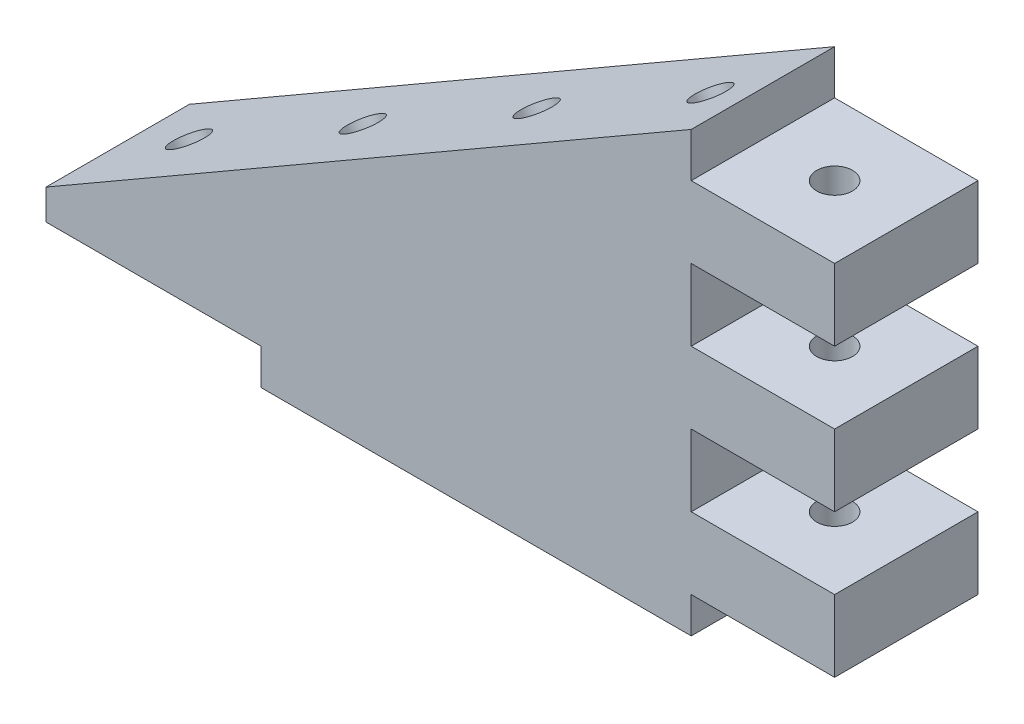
ISO-10303-21;
HEADER;
FILE_DESCRIPTION(('STEP AP214'),'2;1');
FILE_NAME('part.step','',(''),(''),'','','');
FILE_SCHEMA(('AUTOMOTIVE_DESIGN { 1 0 10303 214 1 1 1 1 }'));
ENDSEC;
DATA;
#1=APPLICATION_CONTEXT('core data for automotive mechanical design processes');
#2=APPLICATION_PROTOCOL_DEFINITION('international standard','automotive_design',2000,#1);
#3=PRODUCT_CONTEXT('',#1,'mechanical');
#4=PRODUCT('Part','Part','',(#3));
#5=PRODUCT_RELATED_PRODUCT_CATEGORY('part','',(#4));
#6=PRODUCT_DEFINITION_FORMATION('','',#4);
#7=PRODUCT_DEFINITION_CONTEXT('part definition',#1,'design');
#8=PRODUCT_DEFINITION('design','',#6,#7);
#9=PRODUCT_DEFINITION_SHAPE('','',#8);
#10=(LENGTH_UNIT() NAMED_UNIT(*) SI_UNIT(.MILLI.,.METRE.));
#11=(NAMED_UNIT(*) PLANE_ANGLE_UNIT() SI_UNIT($,.RADIAN.));
#12=(NAMED_UNIT(*) SI_UNIT($,.STERADIAN.) SOLID_ANGLE_UNIT());
#13=UNCERTAINTY_MEASURE_WITH_UNIT(LENGTH_MEASURE(1.E-05),#10,'distance_accuracy_value','');
#14=(GEOMETRIC_REPRESENTATION_CONTEXT(3) GLOBAL_UNCERTAINTY_ASSIGNED_CONTEXT((#13)) GLOBAL_UNIT_ASSIGNED_CONTEXT((#10,
#11,#12)) REPRESENTATION_CONTEXT('',''));
#15=CARTESIAN_POINT('',(0.,0.,0.));
#16=DIRECTION('',(0.,0.,1.));
#17=DIRECTION('',(1.,0.,0.));
#18=AXIS2_PLACEMENT_3D('',#15,#16,#17);
#19=CARTESIAN_POINT('',(10.,0.,10.));
#20=DIRECTION('',(1.,0.,0.));
#21=DIRECTION('',(0.,1.,0.));
#22=AXIS2_PLACEMENT_3D('',#19,#20,#21);
#23=PLANE('',#22);
#24=DIRECTION('',(0.,0.,1.));
#25=VECTOR('',#24,1.);
#26=CARTESIAN_POINT('',(10.,55.,-10.));
#27=LINE('',#26,#25);
#28=CARTESIAN_POINT('',(10.,55.,-10.));
#29=VERTEX_POINT('',#28);
#30=CARTESIAN_POINT('',(10.,55.,10.));
#31=VERTEX_POINT('',#30);
#32=EDGE_CURVE('E60',#29,#31,#27,.T.);
#33=ORIENTED_EDGE('',*,*,#32,.T.);
#34=DIRECTION('',(0.,-1.,0.));
#35=VECTOR('',#34,1.);
#36=CARTESIAN_POINT('',(10.,0.,10.));
#37=LINE('',#36,#35);
#38=CARTESIAN_POINT('',(10.,45.,10.));
#39=VERTEX_POINT('',#38);
#40=EDGE_CURVE('E317',#31,#39,#37,.T.);
#41=ORIENTED_EDGE('',*,*,#40,.T.);
#42=DIRECTION('',(0.,0.,1.));
#43=VECTOR('',#42,1.);
#44=CARTESIAN_POINT('',(10.,45.,-10.));
#45=LINE('',#44,#43);
#46=CARTESIAN_POINT('',(10.,45.,-10.));
#47=VERTEX_POINT('',#46);
#48=EDGE_CURVE('E234',#47,#39,#45,.T.);
#49=ORIENTED_EDGE('',*,*,#48,.F.);
#50=DIRECTION('',(0.,-1.,0.));
#51=VECTOR('',#50,1.);
#52=CARTESIAN_POINT('',(10.,0.,-10.));
#53=LINE('',#52,#51);
#54=EDGE_CURVE('E311',#29,#47,#53,.T.);
#55=ORIENTED_EDGE('',*,*,#54,.F.);
#56=EDGE_LOOP('',(#33,#41,#49,#55));
#57=FACE_BOUND('',#56,.T.);
#58=ADVANCED_FACE('F35',(#57),#23,.T.);
#59=CARTESIAN_POINT('',(0.,0.,0.));
#60=DIRECTION('',(0.,1.,0.));
#61=DIRECTION('',(0.,0.,1.));
#62=AXIS2_PLACEMENT_3D('',#59,#60,#61);
#63=CYLINDRICAL_SURFACE('',#62,2.5);
#64=CARTESIAN_POINT('',(0.,55.,0.));
#65=DIRECTION('',(0.,-1.,0.));
#66=DIRECTION('',(0.,0.,-1.));
#67=AXIS2_PLACEMENT_3D('',#64,#65,#66);
#68=CIRCLE('',#67,2.5);
#69=CARTESIAN_POINT('',(0.,55.,-2.5));
#70=VERTEX_POINT('',#69);
#71=EDGE_CURVE('E205',#70,#70,#68,.F.);
#72=ORIENTED_EDGE('',*,*,#71,.T.);
#73=EDGE_LOOP('',(#72));
#74=FACE_BOUND('',#73,.T.);
#75=CARTESIAN_POINT('',(0.,45.,0.));
#76=DIRECTION('',(0.,1.,0.));
#77=DIRECTION('',(0.,0.,1.));
#78=AXIS2_PLACEMENT_3D('',#75,#76,#77);
#79=CIRCLE('',#78,2.5);
#80=CARTESIAN_POINT('',(0.,45.,2.5));
#81=VERTEX_POINT('',#80);
#82=EDGE_CURVE('E243',#81,#81,#79,.F.);
#83=ORIENTED_EDGE('',*,*,#82,.T.);
#84=EDGE_LOOP('',(#83));
#85=FACE_BOUND('',#84,.T.);
#86=ADVANCED_FACE('F362',(#74,#85),#63,.F.);
#87=DIRECTION('',(0.,0.,1.));
#88=VECTOR('',#87,1.);
#89=CARTESIAN_POINT('',(10.,35.,-10.));
#90=LINE('',#89,#88);
#91=CARTESIAN_POINT('',(10.,35.,-10.));
#92=VERTEX_POINT('',#91);
#93=CARTESIAN_POINT('',(10.,35.,10.));
#94=VERTEX_POINT('',#93);
#95=EDGE_CURVE('E237',#92,#94,#90,.T.);
#96=ORIENTED_EDGE('',*,*,#95,.T.);
#97=CARTESIAN_POINT('',(10.,25.,10.));
#98=VERTEX_POINT('',#97);
#99=EDGE_CURVE('E320',#94,#98,#37,.T.);
#100=ORIENTED_EDGE('',*,*,#99,.T.);
#101=DIRECTION('',(0.,0.,1.));
#102=VECTOR('',#101,1.);
#103=CARTESIAN_POINT('',(10.,25.,-10.));
#104=LINE('',#103,#102);
#105=CARTESIAN_POINT('',(10.,25.,-10.));
#106=VERTEX_POINT('',#105);
#107=EDGE_CURVE('E267',#106,#98,#104,.T.);
#108=ORIENTED_EDGE('',*,*,#107,.F.);
#109=EDGE_CURVE('E328',#92,#106,#53,.T.);
#110=ORIENTED_EDGE('',*,*,#109,.F.);
#111=EDGE_LOOP('',(#96,#100,#108,#110));
#112=FACE_BOUND('',#111,.T.);
#113=ADVANCED_FACE('F365',(#112),#23,.T.);
#114=CARTESIAN_POINT('',(0.,35.,0.));
#115=DIRECTION('',(0.,-1.,0.));
#116=DIRECTION('',(0.,0.,-1.));
#117=AXIS2_PLACEMENT_3D('',#114,#115,#116);
#118=CIRCLE('',#117,2.5);
#119=CARTESIAN_POINT('',(0.,35.,-2.5));
#120=VERTEX_POINT('',#119);
#121=EDGE_CURVE('E233',#120,#120,#118,.F.);
#122=ORIENTED_EDGE('',*,*,#121,.T.);
#123=EDGE_LOOP('',(#122));
#124=FACE_BOUND('',#123,.T.);
#125=CARTESIAN_POINT('',(0.,25.,0.));
#126=DIRECTION('',(0.,1.,0.));
#127=DIRECTION('',(0.,0.,1.));
#128=AXIS2_PLACEMENT_3D('',#125,#126,#127);
#129=CIRCLE('',#128,2.5);
#130=CARTESIAN_POINT('',(0.,25.,2.5));
#131=VERTEX_POINT('',#130);
#132=EDGE_CURVE('E39',#131,#131,#129,.F.);
#133=ORIENTED_EDGE('',*,*,#132,.T.);
#134=EDGE_LOOP('',(#133));
#135=FACE_BOUND('',#134,.T.);
#136=ADVANCED_FACE('F344',(#124,#135),#63,.F.);
#137=CARTESIAN_POINT('',(-28.9951905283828,50.2211431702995,10.));
#138=DIRECTION('',(0.499999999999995,-0.866025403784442,0.));
#139=DIRECTION('',(0.866025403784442,0.499999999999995,0.));
#140=AXIS2_PLACEMENT_3D('',#137,#138,#139);
#141=PLANE('',#140);
#142=CARTESIAN_POINT('',(-41.5692193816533,42.9615242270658,0.));
#143=DIRECTION('',(-0.499999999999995,0.866025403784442,0.));
#144=DIRECTION('',(-0.866025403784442,-0.499999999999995,0.));
#145=AXIS2_PLACEMENT_3D('',#142,#143,#144);
#146=CIRCLE('',#145,2.5);
#147=CARTESIAN_POINT('',(-43.7342828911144,41.7115242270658,0.));
#148=VERTEX_POINT('',#147);
#149=EDGE_CURVE('E274',#148,#148,#146,.T.);
#150=ORIENTED_EDGE('',*,*,#149,.F.);
#151=EDGE_LOOP('',(#150));
#152=FACE_BOUND('',#151,.T.);
#153=CARTESIAN_POINT('',(-17.3205080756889,56.9615242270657,0.));
#154=DIRECTION('',(-0.499999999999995,0.866025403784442,0.));
#155=DIRECTION('',(-0.866025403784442,-0.499999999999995,0.));
#156=AXIS2_PLACEMENT_3D('',#153,#154,#155);
#157=CIRCLE('',#156,2.5);
#158=CARTESIAN_POINT('',(-19.48557158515,55.7115242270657,0.));
#159=VERTEX_POINT('',#158);
#160=EDGE_CURVE('E280',#159,#159,#157,.T.);
#161=ORIENTED_EDGE('',*,*,#160,.F.);
#162=EDGE_LOOP('',(#161));
#163=FACE_BOUND('',#162,.T.);
#164=DIRECTION('',(-0.866025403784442,-0.499999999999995,0.));
#165=VECTOR('',#164,1.);
#166=CARTESIAN_POINT('',(-28.9951905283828,50.2211431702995,10.));
#167=LINE('',#166,#165);
#168=CARTESIAN_POINT('',(-10.,61.1880215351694,10.));
#169=VERTEX_POINT('',#168);
#170=CARTESIAN_POINT('',(-100.,9.22649730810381,10.));
#171=VERTEX_POINT('',#170);
#172=EDGE_CURVE('E307',#169,#171,#167,.T.);
#173=ORIENTED_EDGE('',*,*,#172,.F.);
#174=DIRECTION('',(0.,0.,-1.));
#175=VECTOR('',#174,1.);
#176=CARTESIAN_POINT('',(-10.,61.1880215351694,10.));
#177=LINE('',#176,#175);
#178=CARTESIAN_POINT('',(-10.,61.1880215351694,-10.));
#179=VERTEX_POINT('',#178);
#180=EDGE_CURVE('E210',#169,#179,#177,.T.);
#181=ORIENTED_EDGE('',*,*,#180,.T.);
#182=DIRECTION('',(-0.866025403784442,-0.499999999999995,0.));
#183=VECTOR('',#182,1.);
#184=CARTESIAN_POINT('',(-28.9951905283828,50.2211431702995,-10.));
#185=LINE('',#184,#183);
#186=CARTESIAN_POINT('',(-100.,9.22649730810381,-10.));
#187=VERTEX_POINT('',#186);
#188=EDGE_CURVE('E306',#179,#187,#185,.T.);
#189=ORIENTED_EDGE('',*,*,#188,.T.);
#190=DIRECTION('',(0.,0.,-1.));
#191=VECTOR('',#190,1.);
#192=CARTESIAN_POINT('',(-100.,9.22649730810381,10.));
#193=LINE('',#192,#191);
#194=EDGE_CURVE('E319',#171,#187,#193,.T.);
#195=ORIENTED_EDGE('',*,*,#194,.F.);
#196=EDGE_LOOP('',(#173,#181,#189,#195));
#197=FACE_BOUND('',#196,.T.);
#198=CARTESIAN_POINT('',(-65.8179306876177,28.961524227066,0.));
#199=DIRECTION('',(-0.499999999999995,0.866025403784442,0.));
#200=DIRECTION('',(-0.866025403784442,-0.499999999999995,0.));
#201=AXIS2_PLACEMENT_3D('',#198,#199,#200);
#202=CIRCLE('',#201,2.5);
#203=CARTESIAN_POINT('',(-67.9829941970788,27.711524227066,0.));
#204=VERTEX_POINT('',#203);
#205=EDGE_CURVE('E331',#204,#204,#202,.T.);
#206=ORIENTED_EDGE('',*,*,#205,.F.);
#207=EDGE_LOOP('',(#206));
#208=FACE_BOUND('',#207,.T.);
#209=CARTESIAN_POINT('',(-90.066641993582,14.9615242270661,0.));
#210=DIRECTION('',(-0.499999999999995,0.866025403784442,0.));
#211=DIRECTION('',(-0.866025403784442,-0.499999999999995,0.));
#212=AXIS2_PLACEMENT_3D('',#209,#210,#211);
#213=CIRCLE('',#212,2.5);
#214=CARTESIAN_POINT('',(-92.2317055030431,13.7115242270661,0.));
#215=VERTEX_POINT('',#214);
#216=EDGE_CURVE('E44',#215,#215,#213,.T.);
#217=ORIENTED_EDGE('',*,*,#216,.F.);
#218=EDGE_LOOP('',(#217));
#219=FACE_BOUND('',#218,.T.);
#220=ADVANCED_FACE('F420',(#152,#163,#197,#208,#219),#141,.F.);
#221=CARTESIAN_POINT('',(-100.,0.,10.));
#222=DIRECTION('',(-1.,0.,0.));
#223=DIRECTION('',(0.,0.,1.));
#224=AXIS2_PLACEMENT_3D('',#221,#222,#223);
#225=PLANE('',#224);
#226=DIRECTION('',(0.,0.,1.));
#227=VECTOR('',#226,1.);
#228=CARTESIAN_POINT('',(-100.,5.,-10.));
#229=LINE('',#228,#227);
#230=CARTESIAN_POINT('',(-100.,5.,-10.));
#231=VERTEX_POINT('',#230);
#232=CARTESIAN_POINT('',(-100.,5.,10.));
#233=VERTEX_POINT('',#232);
#234=EDGE_CURVE('E52',#231,#233,#229,.T.);
#235=ORIENTED_EDGE('',*,*,#234,.T.);
#236=DIRECTION('',(0.,1.,0.));
#237=VECTOR('',#236,1.);
#238=CARTESIAN_POINT('',(-100.,0.,10.));
#239=LINE('',#238,#237);
#240=EDGE_CURVE('E310',#233,#171,#239,.T.);
#241=ORIENTED_EDGE('',*,*,#240,.T.);
#242=ORIENTED_EDGE('',*,*,#194,.T.);
#243=DIRECTION('',(0.,1.,0.));
#244=VECTOR('',#243,1.);
#245=CARTESIAN_POINT('',(-100.,0.,-10.));
#246=LINE('',#245,#244);
#247=EDGE_CURVE('E323',#231,#187,#246,.T.);
#248=ORIENTED_EDGE('',*,*,#247,.F.);
#249=EDGE_LOOP('',(#235,#241,#242,#248));
#250=FACE_BOUND('',#249,.T.);
#251=ADVANCED_FACE('F387',(#250),#225,.T.);
#252=CARTESIAN_POINT('',(0.,0.,10.));
#253=DIRECTION('',(0.,-1.,0.));
#254=DIRECTION('',(1.,0.,0.));
#255=AXIS2_PLACEMENT_3D('',#252,#253,#254);
#256=PLANE('',#255);
#257=DIRECTION('',(0.,0.,1.));
#258=VECTOR('',#257,1.);
#259=CARTESIAN_POINT('',(-70.,0.,-10.));
#260=LINE('',#259,#258);
#261=CARTESIAN_POINT('',(-70.,0.,-10.));
#262=VERTEX_POINT('',#261);
#263=CARTESIAN_POINT('',(-70.,0.,10.));
#264=VERTEX_POINT('',#263);
#265=EDGE_CURVE('E191',#262,#264,#260,.T.);
#266=ORIENTED_EDGE('',*,*,#265,.F.);
#267=DIRECTION('',(-1.,0.,0.));
#268=VECTOR('',#267,1.);
#269=CARTESIAN_POINT('',(0.,0.,-10.));
#270=LINE('',#269,#268);
#271=CARTESIAN_POINT('',(-10.,0.,-10.));
#272=VERTEX_POINT('',#271);
#273=EDGE_CURVE('E181',#272,#262,#270,.T.);
#274=ORIENTED_EDGE('',*,*,#273,.F.);
#275=DIRECTION('',(0.,0.,-1.));
#276=VECTOR('',#275,1.);
#277=CARTESIAN_POINT('',(-10.,0.,10.));
#278=LINE('',#277,#276);
#279=CARTESIAN_POINT('',(-10.,0.,10.));
#280=VERTEX_POINT('',#279);
#281=EDGE_CURVE('E302',#280,#272,#278,.T.);
#282=ORIENTED_EDGE('',*,*,#281,.F.);
#283=DIRECTION('',(-1.,0.,0.));
#284=VECTOR('',#283,1.);
#285=CARTESIAN_POINT('',(0.,0.,10.));
#286=LINE('',#285,#284);
#287=EDGE_CURVE('E313',#280,#264,#286,.T.);
#288=ORIENTED_EDGE('',*,*,#287,.T.);
#289=EDGE_LOOP('',(#266,#274,#282,#288));
#290=FACE_BOUND('',#289,.T.);
#291=ADVANCED_FACE('F379',(#290),#256,.T.);
#292=DIRECTION('',(0.,0.,1.));
#293=VECTOR('',#292,1.);
#294=CARTESIAN_POINT('',(10.,15.,-10.));
#295=LINE('',#294,#293);
#296=CARTESIAN_POINT('',(10.,15.,-10.));
#297=VERTEX_POINT('',#296);
#298=CARTESIAN_POINT('',(10.,15.,10.));
#299=VERTEX_POINT('',#298);
#300=EDGE_CURVE('E270',#297,#299,#295,.T.);
#301=ORIENTED_EDGE('',*,*,#300,.T.);
#302=CARTESIAN_POINT('',(10.,5.,10.));
#303=VERTEX_POINT('',#302);
#304=EDGE_CURVE('E316',#299,#303,#37,.T.);
#305=ORIENTED_EDGE('',*,*,#304,.T.);
#306=DIRECTION('',(0.,0.,1.));
#307=VECTOR('',#306,1.);
#308=CARTESIAN_POINT('',(10.,5.,-10.));
#309=LINE('',#308,#307);
#310=CARTESIAN_POINT('',(10.,5.,-10.));
#311=VERTEX_POINT('',#310);
#312=EDGE_CURVE('E296',#311,#303,#309,.T.);
#313=ORIENTED_EDGE('',*,*,#312,.F.);
#314=EDGE_CURVE('E326',#297,#311,#53,.T.);
#315=ORIENTED_EDGE('',*,*,#314,.F.);
#316=EDGE_LOOP('',(#301,#305,#313,#315));
#317=FACE_BOUND('',#316,.T.);
#318=ADVANCED_FACE('F366',(#317),#23,.T.);
#319=CARTESIAN_POINT('',(0.,0.,10.));
#320=DIRECTION('',(0.,0.,1.));
#321=DIRECTION('',(1.,0.,0.));
#322=AXIS2_PLACEMENT_3D('',#319,#320,#321);
#323=PLANE('',#322);
#324=DIRECTION('',(0.,1.,0.));
#325=VECTOR('',#324,1.);
#326=CARTESIAN_POINT('',(-70.,5.,10.));
#327=LINE('',#326,#325);
#328=CARTESIAN_POINT('',(-70.,5.,10.));
#329=VERTEX_POINT('',#328);
#330=EDGE_CURVE('E169',#264,#329,#327,.T.);
#331=ORIENTED_EDGE('',*,*,#330,.F.);
#332=ORIENTED_EDGE('',*,*,#287,.F.);
#333=DIRECTION('',(0.,-1.,0.));
#334=VECTOR('',#333,1.);
#335=CARTESIAN_POINT('',(-10.,-5.,10.));
#336=LINE('',#335,#334);
#337=CARTESIAN_POINT('',(-10.,5.,10.));
#338=VERTEX_POINT('',#337);
#339=EDGE_CURVE('E289',#338,#280,#336,.T.);
#340=ORIENTED_EDGE('',*,*,#339,.F.);
#341=DIRECTION('',(-1.,0.,0.));
#342=VECTOR('',#341,1.);
#343=CARTESIAN_POINT('',(10.,5.,10.));
#344=LINE('',#343,#342);
#345=EDGE_CURVE('E293',#303,#338,#344,.T.);
#346=ORIENTED_EDGE('',*,*,#345,.F.);
#347=ORIENTED_EDGE('',*,*,#304,.F.);
#348=DIRECTION('',(1.,0.,0.));
#349=VECTOR('',#348,1.);
#350=CARTESIAN_POINT('',(10.,15.,10.));
#351=LINE('',#350,#349);
#352=CARTESIAN_POINT('',(-10.,15.,10.));
#353=VERTEX_POINT('',#352);
#354=EDGE_CURVE('E260',#353,#299,#351,.T.);
#355=ORIENTED_EDGE('',*,*,#354,.F.);
#356=DIRECTION('',(0.,-1.,0.));
#357=VECTOR('',#356,1.);
#358=CARTESIAN_POINT('',(-10.,15.,10.));
#359=LINE('',#358,#357);
#360=CARTESIAN_POINT('',(-10.,25.,10.));
#361=VERTEX_POINT('',#360);
#362=EDGE_CURVE('E246',#361,#353,#359,.T.);
#363=ORIENTED_EDGE('',*,*,#362,.F.);
#364=DIRECTION('',(-1.,0.,0.));
#365=VECTOR('',#364,1.);
#366=CARTESIAN_POINT('',(10.,25.,10.));
#367=LINE('',#366,#365);
#368=EDGE_CURVE('E251',#98,#361,#367,.T.);
#369=ORIENTED_EDGE('',*,*,#368,.F.);
#370=ORIENTED_EDGE('',*,*,#99,.F.);
#371=DIRECTION('',(1.,0.,0.));
#372=VECTOR('',#371,1.);
#373=CARTESIAN_POINT('',(10.,35.,10.));
#374=LINE('',#373,#372);
#375=CARTESIAN_POINT('',(-10.,35.,10.));
#376=VERTEX_POINT('',#375);
#377=EDGE_CURVE('E227',#376,#94,#374,.T.);
#378=ORIENTED_EDGE('',*,*,#377,.F.);
#379=DIRECTION('',(0.,-1.,0.));
#380=VECTOR('',#379,1.);
#381=CARTESIAN_POINT('',(-10.,35.,10.));
#382=LINE('',#381,#380);
#383=CARTESIAN_POINT('',(-10.,45.,10.));
#384=VERTEX_POINT('',#383);
#385=EDGE_CURVE('E213',#384,#376,#382,.T.);
#386=ORIENTED_EDGE('',*,*,#385,.F.);
#387=DIRECTION('',(-1.,0.,0.));
#388=VECTOR('',#387,1.);
#389=CARTESIAN_POINT('',(10.,45.,10.));
#390=LINE('',#389,#388);
#391=EDGE_CURVE('E218',#39,#384,#390,.T.);
#392=ORIENTED_EDGE('',*,*,#391,.F.);
#393=ORIENTED_EDGE('',*,*,#40,.F.);
#394=DIRECTION('',(1.,0.,0.));
#395=VECTOR('',#394,1.);
#396=CARTESIAN_POINT('',(10.,55.,10.));
#397=LINE('',#396,#395);
#398=CARTESIAN_POINT('',(-10.,55.,10.));
#399=VERTEX_POINT('',#398);
#400=EDGE_CURVE('E199',#399,#31,#397,.T.);
#401=ORIENTED_EDGE('',*,*,#400,.F.);
#402=DIRECTION('',(0.,-1.,0.));
#403=VECTOR('',#402,1.);
#404=CARTESIAN_POINT('',(-10.,55.,10.));
#405=LINE('',#404,#403);
#406=EDGE_CURVE('E193',#169,#399,#405,.T.);
#407=ORIENTED_EDGE('',*,*,#406,.F.);
#408=ORIENTED_EDGE('',*,*,#172,.T.);
#409=ORIENTED_EDGE('',*,*,#240,.F.);
#410=DIRECTION('',(-1.,0.,0.));
#411=VECTOR('',#410,1.);
#412=CARTESIAN_POINT('',(-100.,5.,10.));
#413=LINE('',#412,#411);
#414=EDGE_CURVE('E182',#329,#233,#413,.T.);
#415=ORIENTED_EDGE('',*,*,#414,.F.);
#416=EDGE_LOOP('',(#331,#332,#340,#346,#347,#355,#363,#369,#370,#378,#386,#392,#393,#401,#407,
#408,#409,#415));
#417=FACE_BOUND('',#416,.T.);
#418=ADVANCED_FACE('F378',(#417),#323,.T.);
#419=CARTESIAN_POINT('',(0.,0.,-10.));
#420=DIRECTION('',(0.,0.,1.));
#421=DIRECTION('',(1.,0.,0.));
#422=AXIS2_PLACEMENT_3D('',#419,#420,#421);
#423=PLANE('',#422);
#424=ORIENTED_EDGE('',*,*,#273,.T.);
#425=DIRECTION('',(0.,1.,0.));
#426=VECTOR('',#425,1.);
#427=CARTESIAN_POINT('',(-70.,5.,-10.));
#428=LINE('',#427,#426);
#429=CARTESIAN_POINT('',(-70.,5.,-10.));
#430=VERTEX_POINT('',#429);
#431=EDGE_CURVE('E166',#262,#430,#428,.T.);
#432=ORIENTED_EDGE('',*,*,#431,.T.);
#433=DIRECTION('',(-1.,0.,0.));
#434=VECTOR('',#433,1.);
#435=CARTESIAN_POINT('',(-100.,5.,-10.));
#436=LINE('',#435,#434);
#437=EDGE_CURVE('E171',#430,#231,#436,.T.);
#438=ORIENTED_EDGE('',*,*,#437,.T.);
#439=ORIENTED_EDGE('',*,*,#247,.T.);
#440=ORIENTED_EDGE('',*,*,#188,.F.);
#441=DIRECTION('',(0.,-1.,0.));
#442=VECTOR('',#441,1.);
#443=CARTESIAN_POINT('',(-10.,55.,-10.));
#444=LINE('',#443,#442);
#445=CARTESIAN_POINT('',(-10.,55.,-10.));
#446=VERTEX_POINT('',#445);
#447=EDGE_CURVE('E195',#179,#446,#444,.T.);
#448=ORIENTED_EDGE('',*,*,#447,.T.);
#449=DIRECTION('',(1.,0.,0.));
#450=VECTOR('',#449,1.);
#451=CARTESIAN_POINT('',(10.,55.,-10.));
#452=LINE('',#451,#450);
#453=EDGE_CURVE('E198',#446,#29,#452,.T.);
#454=ORIENTED_EDGE('',*,*,#453,.T.);
#455=ORIENTED_EDGE('',*,*,#54,.T.);
#456=DIRECTION('',(-1.,0.,0.));
#457=VECTOR('',#456,1.);
#458=CARTESIAN_POINT('',(10.,45.,-10.));
#459=LINE('',#458,#457);
#460=CARTESIAN_POINT('',(-10.,45.,-10.));
#461=VERTEX_POINT('',#460);
#462=EDGE_CURVE('E221',#47,#461,#459,.T.);
#463=ORIENTED_EDGE('',*,*,#462,.T.);
#464=DIRECTION('',(0.,-1.,0.));
#465=VECTOR('',#464,1.);
#466=CARTESIAN_POINT('',(-10.,35.,-10.));
#467=LINE('',#466,#465);
#468=CARTESIAN_POINT('',(-10.,35.,-10.));
#469=VERTEX_POINT('',#468);
#470=EDGE_CURVE('E214',#461,#469,#467,.T.);
#471=ORIENTED_EDGE('',*,*,#470,.T.);
#472=DIRECTION('',(1.,0.,0.));
#473=VECTOR('',#472,1.);
#474=CARTESIAN_POINT('',(10.,35.,-10.));
#475=LINE('',#474,#473);
#476=EDGE_CURVE('E217',#469,#92,#475,.T.);
#477=ORIENTED_EDGE('',*,*,#476,.T.);
#478=ORIENTED_EDGE('',*,*,#109,.T.);
#479=DIRECTION('',(-1.,0.,0.));
#480=VECTOR('',#479,1.);
#481=CARTESIAN_POINT('',(10.,25.,-10.));
#482=LINE('',#481,#480);
#483=CARTESIAN_POINT('',(-10.,25.,-10.));
#484=VERTEX_POINT('',#483);
#485=EDGE_CURVE('E254',#106,#484,#482,.T.);
#486=ORIENTED_EDGE('',*,*,#485,.T.);
#487=DIRECTION('',(0.,-1.,0.));
#488=VECTOR('',#487,1.);
#489=CARTESIAN_POINT('',(-10.,15.,-10.));
#490=LINE('',#489,#488);
#491=CARTESIAN_POINT('',(-10.,15.,-10.));
#492=VERTEX_POINT('',#491);
#493=EDGE_CURVE('E247',#484,#492,#490,.T.);
#494=ORIENTED_EDGE('',*,*,#493,.T.);
#495=DIRECTION('',(1.,0.,0.));
#496=VECTOR('',#495,1.);
#497=CARTESIAN_POINT('',(10.,15.,-10.));
#498=LINE('',#497,#496);
#499=EDGE_CURVE('E250',#492,#297,#498,.T.);
#500=ORIENTED_EDGE('',*,*,#499,.T.);
#501=ORIENTED_EDGE('',*,*,#314,.T.);
#502=DIRECTION('',(-1.,0.,0.));
#503=VECTOR('',#502,1.);
#504=CARTESIAN_POINT('',(10.,5.,-10.));
#505=LINE('',#504,#503);
#506=CARTESIAN_POINT('',(-10.,5.,-10.));
#507=VERTEX_POINT('',#506);
#508=EDGE_CURVE('E292',#311,#507,#505,.T.);
#509=ORIENTED_EDGE('',*,*,#508,.T.);
#510=DIRECTION('',(0.,-1.,0.));
#511=VECTOR('',#510,1.);
#512=CARTESIAN_POINT('',(-10.,-5.,-10.));
#513=LINE('',#512,#511);
#514=EDGE_CURVE('E290',#507,#272,#513,.T.);
#515=ORIENTED_EDGE('',*,*,#514,.T.);
#516=EDGE_LOOP('',(#424,#432,#438,#439,#440,#448,#454,#455,#463,#471,#477,#478,#486,#494,#500,
#501,#509,#515));
#517=FACE_BOUND('',#516,.T.);
#518=ADVANCED_FACE('F178',(#517),#423,.F.);
#519=CARTESIAN_POINT('',(-10.,-5.,-10.));
#520=DIRECTION('',(-1.,0.,0.));
#521=DIRECTION('',(0.,0.,1.));
#522=AXIS2_PLACEMENT_3D('',#519,#520,#521);
#523=PLANE('',#522);
#524=ORIENTED_EDGE('',*,*,#281,.T.);
#525=ORIENTED_EDGE('',*,*,#514,.F.);
#526=DIRECTION('',(0.,0.,1.));
#527=VECTOR('',#526,1.);
#528=CARTESIAN_POINT('',(-10.,5.,-10.));
#529=LINE('',#528,#527);
#530=EDGE_CURVE('E300',#507,#338,#529,.T.);
#531=ORIENTED_EDGE('',*,*,#530,.T.);
#532=ORIENTED_EDGE('',*,*,#339,.T.);
#533=EDGE_LOOP('',(#524,#525,#531,#532));
#534=FACE_BOUND('',#533,.T.);
#535=ADVANCED_FACE('F411',(#534),#523,.F.);
#536=CARTESIAN_POINT('',(10.,5.,-10.));
#537=DIRECTION('',(0.,1.,0.));
#538=DIRECTION('',(0.,0.,1.));
#539=AXIS2_PLACEMENT_3D('',#536,#537,#538);
#540=PLANE('',#539);
#541=CARTESIAN_POINT('',(0.,5.,0.));
#542=DIRECTION('',(0.,1.,0.));
#543=DIRECTION('',(0.,0.,1.));
#544=AXIS2_PLACEMENT_3D('',#541,#542,#543);
#545=CIRCLE('',#544,2.5);
#546=CARTESIAN_POINT('',(0.,5.,2.5));
#547=VERTEX_POINT('',#546);
#548=EDGE_CURVE('E284',#547,#547,#545,.T.);
#549=ORIENTED_EDGE('',*,*,#548,.T.);
#550=EDGE_LOOP('',(#549));
#551=FACE_BOUND('',#550,.T.);
#552=ORIENTED_EDGE('',*,*,#345,.T.);
#553=ORIENTED_EDGE('',*,*,#530,.F.);
#554=ORIENTED_EDGE('',*,*,#508,.F.);
#555=ORIENTED_EDGE('',*,*,#312,.T.);
#556=EDGE_LOOP('',(#552,#553,#554,#555));
#557=FACE_BOUND('',#556,.T.);
#558=ADVANCED_FACE('F409',(#551,#557),#540,.F.);
#559=CARTESIAN_POINT('',(0.,15.,0.));
#560=DIRECTION('',(0.,-1.,0.));
#561=DIRECTION('',(0.,0.,-1.));
#562=AXIS2_PLACEMENT_3D('',#559,#560,#561);
#563=CIRCLE('',#562,2.5);
#564=CARTESIAN_POINT('',(0.,15.,-2.5));
#565=VERTEX_POINT('',#564);
#566=EDGE_CURVE('E266',#565,#565,#563,.F.);
#567=ORIENTED_EDGE('',*,*,#566,.T.);
#568=EDGE_LOOP('',(#567));
#569=FACE_BOUND('',#568,.T.);
#570=ORIENTED_EDGE('',*,*,#548,.F.);
#571=EDGE_LOOP('',(#570));
#572=FACE_BOUND('',#571,.T.);
#573=ADVANCED_FACE('F372',(#569,#572),#63,.F.);
#574=CARTESIAN_POINT('',(-14.820508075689,52.6313972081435,0.));
#575=DIRECTION('',(-0.499999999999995,0.866025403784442,0.));
#576=DIRECTION('',(-0.866025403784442,-0.499999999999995,0.));
#577=AXIS2_PLACEMENT_3D('',#574,#575,#576);
#578=CYLINDRICAL_SURFACE('',#577,2.5);
#579=CARTESIAN_POINT('',(-14.820508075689,52.6313972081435,0.));
#580=DIRECTION('',(-0.499999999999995,0.866025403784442,0.));
#581=DIRECTION('',(-0.866025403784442,-0.499999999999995,0.));
#582=AXIS2_PLACEMENT_3D('',#579,#580,#581);
#583=CIRCLE('',#582,2.5);
#584=CARTESIAN_POINT('',(-16.9855715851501,51.3813972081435,0.));
#585=VERTEX_POINT('',#584);
#586=EDGE_CURVE('E281',#585,#585,#583,.T.);
#587=ORIENTED_EDGE('',*,*,#586,.F.);
#588=EDGE_LOOP('',(#587));
#589=FACE_BOUND('',#588,.T.);
#590=ORIENTED_EDGE('',*,*,#160,.T.);
#591=EDGE_LOOP('',(#590));
#592=FACE_BOUND('',#591,.T.);
#593=ADVANCED_FACE('F456',(#589,#592),#578,.F.);
#594=CARTESIAN_POINT('',(-14.820508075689,52.6313972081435,0.));
#595=DIRECTION('',(-0.499999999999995,0.866025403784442,0.));
#596=DIRECTION('',(-0.866025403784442,-0.499999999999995,0.));
#597=AXIS2_PLACEMENT_3D('',#594,#595,#596);
#598=PLANE('',#597);
#599=ORIENTED_EDGE('',*,*,#586,.T.);
#600=EDGE_LOOP('',(#599));
#601=FACE_BOUND('',#600,.T.);
#602=ADVANCED_FACE('F461',(#601),#598,.T.);
#603=CARTESIAN_POINT('',(-39.0692193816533,38.6313972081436,0.));
#604=DIRECTION('',(-0.499999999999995,0.866025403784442,0.));
#605=DIRECTION('',(-0.866025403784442,-0.499999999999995,0.));
#606=AXIS2_PLACEMENT_3D('',#603,#604,#605);
#607=CYLINDRICAL_SURFACE('',#606,2.5);
#608=CARTESIAN_POINT('',(-39.0692193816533,38.6313972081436,0.));
#609=DIRECTION('',(-0.499999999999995,0.866025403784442,0.));
#610=DIRECTION('',(-0.866025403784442,-0.499999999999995,0.));
#611=AXIS2_PLACEMENT_3D('',#608,#609,#610);
#612=CIRCLE('',#611,2.5);
#613=CARTESIAN_POINT('',(-41.2342828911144,37.3813972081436,0.));
#614=VERTEX_POINT('',#613);
#615=EDGE_CURVE('E277',#614,#614,#612,.T.);
#616=ORIENTED_EDGE('',*,*,#615,.F.);
#617=EDGE_LOOP('',(#616));
#618=FACE_BOUND('',#617,.T.);
#619=ORIENTED_EDGE('',*,*,#149,.T.);
#620=EDGE_LOOP('',(#619));
#621=FACE_BOUND('',#620,.T.);
#622=ADVANCED_FACE('F500',(#618,#621),#607,.F.);
#623=CARTESIAN_POINT('',(-39.0692193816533,38.6313972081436,0.));
#624=DIRECTION('',(-0.499999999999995,0.866025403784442,0.));
#625=DIRECTION('',(-0.866025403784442,-0.499999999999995,0.));
#626=AXIS2_PLACEMENT_3D('',#623,#624,#625);
#627=PLANE('',#626);
#628=ORIENTED_EDGE('',*,*,#615,.T.);
#629=EDGE_LOOP('',(#628));
#630=FACE_BOUND('',#629,.T.);
#631=ADVANCED_FACE('F510',(#630),#627,.T.);
#632=CARTESIAN_POINT('',(-63.3179306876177,24.6313972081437,0.));
#633=DIRECTION('',(-0.499999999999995,0.866025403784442,0.));
#634=DIRECTION('',(-0.866025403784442,-0.499999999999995,0.));
#635=AXIS2_PLACEMENT_3D('',#632,#633,#634);
#636=PLANE('',#635);
#637=CARTESIAN_POINT('',(-63.3179306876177,24.6313972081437,0.));
#638=DIRECTION('',(-0.499999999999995,0.866025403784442,0.));
#639=DIRECTION('',(-0.866025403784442,-0.499999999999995,0.));
#640=AXIS2_PLACEMENT_3D('',#637,#638,#639);
#641=CIRCLE('',#640,2.5);
#642=CARTESIAN_POINT('',(-65.4829941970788,23.3813972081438,0.));
#643=VERTEX_POINT('',#642);
#644=EDGE_CURVE('E334',#643,#643,#641,.T.);
#645=ORIENTED_EDGE('',*,*,#644,.T.);
#646=EDGE_LOOP('',(#645));
#647=FACE_BOUND('',#646,.T.);
#648=ADVANCED_FACE('F520',(#647),#636,.T.);
#649=CARTESIAN_POINT('',(-63.3179306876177,24.6313972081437,0.));
#650=DIRECTION('',(-0.499999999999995,0.866025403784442,0.));
#651=DIRECTION('',(-0.866025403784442,-0.499999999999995,0.));
#652=AXIS2_PLACEMENT_3D('',#649,#650,#651);
#653=CYLINDRICAL_SURFACE('',#652,2.5);
#654=ORIENTED_EDGE('',*,*,#644,.F.);
#655=EDGE_LOOP('',(#654));
#656=FACE_BOUND('',#655,.T.);
#657=ORIENTED_EDGE('',*,*,#205,.T.);
#658=EDGE_LOOP('',(#657));
#659=FACE_BOUND('',#658,.T.);
#660=ADVANCED_FACE('F530',(#656,#659),#653,.F.);
#661=CARTESIAN_POINT('',(-87.5666419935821,10.6313972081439,0.));
#662=DIRECTION('',(-0.499999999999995,0.866025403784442,0.));
#663=DIRECTION('',(-0.866025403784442,-0.499999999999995,0.));
#664=AXIS2_PLACEMENT_3D('',#661,#662,#663);
#665=PLANE('',#664);
#666=CARTESIAN_POINT('',(-87.5666419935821,10.6313972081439,0.));
#667=DIRECTION('',(-0.499999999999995,0.866025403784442,0.));
#668=DIRECTION('',(-0.866025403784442,-0.499999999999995,0.));
#669=AXIS2_PLACEMENT_3D('',#666,#667,#668);
#670=CIRCLE('',#669,2.5);
#671=CARTESIAN_POINT('',(-89.7317055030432,9.3813972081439,0.));
#672=VERTEX_POINT('',#671);
#673=EDGE_CURVE('E11',#672,#672,#670,.T.);
#674=ORIENTED_EDGE('',*,*,#673,.T.);
#675=EDGE_LOOP('',(#674));
#676=FACE_BOUND('',#675,.T.);
#677=ADVANCED_FACE('F37',(#676),#665,.T.);
#678=CARTESIAN_POINT('',(-87.5666419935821,10.6313972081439,0.));
#679=DIRECTION('',(-0.499999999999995,0.866025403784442,0.));
#680=DIRECTION('',(-0.866025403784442,-0.499999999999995,0.));
#681=AXIS2_PLACEMENT_3D('',#678,#679,#680);
#682=CYLINDRICAL_SURFACE('',#681,2.5);
#683=ORIENTED_EDGE('',*,*,#673,.F.);
#684=EDGE_LOOP('',(#683));
#685=FACE_BOUND('',#684,.T.);
#686=ORIENTED_EDGE('',*,*,#216,.T.);
#687=EDGE_LOOP('',(#686));
#688=FACE_BOUND('',#687,.T.);
#689=ADVANCED_FACE('F349',(#685,#688),#682,.F.);
#690=CARTESIAN_POINT('',(10.,25.,-10.));
#691=DIRECTION('',(0.,1.,0.));
#692=DIRECTION('',(0.,0.,1.));
#693=AXIS2_PLACEMENT_3D('',#690,#691,#692);
#694=PLANE('',#693);
#695=ORIENTED_EDGE('',*,*,#368,.T.);
#696=DIRECTION('',(0.,0.,1.));
#697=VECTOR('',#696,1.);
#698=CARTESIAN_POINT('',(-10.,25.,-10.));
#699=LINE('',#698,#697);
#700=EDGE_CURVE('E264',#484,#361,#699,.T.);
#701=ORIENTED_EDGE('',*,*,#700,.F.);
#702=ORIENTED_EDGE('',*,*,#485,.F.);
#703=ORIENTED_EDGE('',*,*,#107,.T.);
#704=EDGE_LOOP('',(#695,#701,#702,#703));
#705=FACE_BOUND('',#704,.T.);
#706=ORIENTED_EDGE('',*,*,#132,.F.);
#707=EDGE_LOOP('',(#706));
#708=FACE_BOUND('',#707,.T.);
#709=ADVANCED_FACE('F346',(#705,#708),#694,.F.);
#710=CARTESIAN_POINT('',(10.,15.,-10.));
#711=DIRECTION('',(0.,-1.,0.));
#712=DIRECTION('',(0.,0.,-1.));
#713=AXIS2_PLACEMENT_3D('',#710,#711,#712);
#714=PLANE('',#713);
#715=ORIENTED_EDGE('',*,*,#354,.T.);
#716=ORIENTED_EDGE('',*,*,#300,.F.);
#717=ORIENTED_EDGE('',*,*,#499,.F.);
#718=DIRECTION('',(0.,0.,1.));
#719=VECTOR('',#718,1.);
#720=CARTESIAN_POINT('',(-10.,15.,-10.));
#721=LINE('',#720,#719);
#722=EDGE_CURVE('E257',#492,#353,#721,.T.);
#723=ORIENTED_EDGE('',*,*,#722,.T.);
#724=EDGE_LOOP('',(#715,#716,#717,#723));
#725=FACE_BOUND('',#724,.T.);
#726=ORIENTED_EDGE('',*,*,#566,.F.);
#727=EDGE_LOOP('',(#726));
#728=FACE_BOUND('',#727,.T.);
#729=ADVANCED_FACE('F348',(#725,#728),#714,.F.);
#730=CARTESIAN_POINT('',(-10.,15.,-10.));
#731=DIRECTION('',(-1.,0.,0.));
#732=DIRECTION('',(0.,0.,1.));
#733=AXIS2_PLACEMENT_3D('',#730,#731,#732);
#734=PLANE('',#733);
#735=ORIENTED_EDGE('',*,*,#362,.T.);
#736=ORIENTED_EDGE('',*,*,#722,.F.);
#737=ORIENTED_EDGE('',*,*,#493,.F.);
#738=ORIENTED_EDGE('',*,*,#700,.T.);
#739=EDGE_LOOP('',(#735,#736,#737,#738));
#740=FACE_BOUND('',#739,.T.);
#741=ADVANCED_FACE('F356',(#740),#734,.F.);
#742=CARTESIAN_POINT('',(10.,45.,-10.));
#743=DIRECTION('',(0.,1.,0.));
#744=DIRECTION('',(0.,0.,1.));
#745=AXIS2_PLACEMENT_3D('',#742,#743,#744);
#746=PLANE('',#745);
#747=ORIENTED_EDGE('',*,*,#391,.T.);
#748=DIRECTION('',(0.,0.,1.));
#749=VECTOR('',#748,1.);
#750=CARTESIAN_POINT('',(-10.,45.,-10.));
#751=LINE('',#750,#749);
#752=EDGE_CURVE('E231',#461,#384,#751,.T.);
#753=ORIENTED_EDGE('',*,*,#752,.F.);
#754=ORIENTED_EDGE('',*,*,#462,.F.);
#755=ORIENTED_EDGE('',*,*,#48,.T.);
#756=EDGE_LOOP('',(#747,#753,#754,#755));
#757=FACE_BOUND('',#756,.T.);
#758=ORIENTED_EDGE('',*,*,#82,.F.);
#759=EDGE_LOOP('',(#758));
#760=FACE_BOUND('',#759,.T.);
#761=ADVANCED_FACE('F434',(#757,#760),#746,.F.);
#762=CARTESIAN_POINT('',(10.,35.,-10.));
#763=DIRECTION('',(0.,-1.,0.));
#764=DIRECTION('',(0.,0.,-1.));
#765=AXIS2_PLACEMENT_3D('',#762,#763,#764);
#766=PLANE('',#765);
#767=ORIENTED_EDGE('',*,*,#377,.T.);
#768=ORIENTED_EDGE('',*,*,#95,.F.);
#769=ORIENTED_EDGE('',*,*,#476,.F.);
#770=DIRECTION('',(0.,0.,1.));
#771=VECTOR('',#770,1.);
#772=CARTESIAN_POINT('',(-10.,35.,-10.));
#773=LINE('',#772,#771);
#774=EDGE_CURVE('E224',#469,#376,#773,.T.);
#775=ORIENTED_EDGE('',*,*,#774,.T.);
#776=EDGE_LOOP('',(#767,#768,#769,#775));
#777=FACE_BOUND('',#776,.T.);
#778=ORIENTED_EDGE('',*,*,#121,.F.);
#779=EDGE_LOOP('',(#778));
#780=FACE_BOUND('',#779,.T.);
#781=ADVANCED_FACE('F441',(#777,#780),#766,.F.);
#782=CARTESIAN_POINT('',(-10.,35.,-10.));
#783=DIRECTION('',(-1.,0.,0.));
#784=DIRECTION('',(0.,0.,1.));
#785=AXIS2_PLACEMENT_3D('',#782,#783,#784);
#786=PLANE('',#785);
#787=ORIENTED_EDGE('',*,*,#385,.T.);
#788=ORIENTED_EDGE('',*,*,#774,.F.);
#789=ORIENTED_EDGE('',*,*,#470,.F.);
#790=ORIENTED_EDGE('',*,*,#752,.T.);
#791=EDGE_LOOP('',(#787,#788,#789,#790));
#792=FACE_BOUND('',#791,.T.);
#793=ADVANCED_FACE('F439',(#792),#786,.F.);
#794=CARTESIAN_POINT('',(-10.,55.,-10.));
#795=DIRECTION('',(-1.,0.,0.));
#796=DIRECTION('',(0.,0.,1.));
#797=AXIS2_PLACEMENT_3D('',#794,#795,#796);
#798=PLANE('',#797);
#799=ORIENTED_EDGE('',*,*,#406,.T.);
#800=DIRECTION('',(0.,0.,1.));
#801=VECTOR('',#800,1.);
#802=CARTESIAN_POINT('',(-10.,55.,-10.));
#803=LINE('',#802,#801);
#804=EDGE_CURVE('E201',#446,#399,#803,.T.);
#805=ORIENTED_EDGE('',*,*,#804,.F.);
#806=ORIENTED_EDGE('',*,*,#447,.F.);
#807=ORIENTED_EDGE('',*,*,#180,.F.);
#808=EDGE_LOOP('',(#799,#805,#806,#807));
#809=FACE_BOUND('',#808,.T.);
#810=ADVANCED_FACE('F424',(#809),#798,.F.);
#811=CARTESIAN_POINT('',(10.,55.,-10.));
#812=DIRECTION('',(0.,-1.,0.));
#813=DIRECTION('',(0.,0.,-1.));
#814=AXIS2_PLACEMENT_3D('',#811,#812,#813);
#815=PLANE('',#814);
#816=ORIENTED_EDGE('',*,*,#400,.T.);
#817=ORIENTED_EDGE('',*,*,#32,.F.);
#818=ORIENTED_EDGE('',*,*,#453,.F.);
#819=ORIENTED_EDGE('',*,*,#804,.T.);
#820=EDGE_LOOP('',(#816,#817,#818,#819));
#821=FACE_BOUND('',#820,.T.);
#822=ORIENTED_EDGE('',*,*,#71,.F.);
#823=EDGE_LOOP('',(#822));
#824=FACE_BOUND('',#823,.T.);
#825=ADVANCED_FACE('F428',(#821,#824),#815,.F.);
#826=CARTESIAN_POINT('',(-70.,5.,-10.));
#827=DIRECTION('',(1.,0.,0.));
#828=DIRECTION('',(0.,0.,-1.));
#829=AXIS2_PLACEMENT_3D('',#826,#827,#828);
#830=PLANE('',#829);
#831=ORIENTED_EDGE('',*,*,#330,.T.);
#832=DIRECTION('',(0.,0.,1.));
#833=VECTOR('',#832,1.);
#834=CARTESIAN_POINT('',(-70.,5.,-10.));
#835=LINE('',#834,#833);
#836=EDGE_CURVE('E163',#430,#329,#835,.T.);
#837=ORIENTED_EDGE('',*,*,#836,.F.);
#838=ORIENTED_EDGE('',*,*,#431,.F.);
#839=ORIENTED_EDGE('',*,*,#265,.T.);
#840=EDGE_LOOP('',(#831,#837,#838,#839));
#841=FACE_BOUND('',#840,.T.);
#842=ADVANCED_FACE('F164',(#841),#830,.F.);
#843=CARTESIAN_POINT('',(-100.,5.,-10.));
#844=DIRECTION('',(0.,1.,0.));
#845=DIRECTION('',(0.,0.,1.));
#846=AXIS2_PLACEMENT_3D('',#843,#844,#845);
#847=PLANE('',#846);
#848=CARTESIAN_POINT('',(-80.,5.,0.));
#849=DIRECTION('',(0.,-1.,0.));
#850=DIRECTION('',(0.,0.,-1.));
#851=AXIS2_PLACEMENT_3D('',#848,#849,#850);
#852=CIRCLE('',#851,2.5);
#853=CARTESIAN_POINT('',(-80.,5.,-2.5));
#854=VERTEX_POINT('',#853);
#855=EDGE_CURVE('E186',#854,#854,#852,.T.);
#856=ORIENTED_EDGE('',*,*,#855,.F.);
#857=EDGE_LOOP('',(#856));
#858=FACE_BOUND('',#857,.T.);
#859=ORIENTED_EDGE('',*,*,#414,.T.);
#860=ORIENTED_EDGE('',*,*,#234,.F.);
#861=ORIENTED_EDGE('',*,*,#437,.F.);
#862=ORIENTED_EDGE('',*,*,#836,.T.);
#863=EDGE_LOOP('',(#859,#860,#861,#862));
#864=FACE_BOUND('',#863,.T.);
#865=ADVANCED_FACE('F173',(#858,#864),#847,.F.);
#866=CARTESIAN_POINT('',(-80.,10.,0.));
#867=DIRECTION('',(0.,-1.,0.));
#868=DIRECTION('',(0.,0.,-1.));
#869=AXIS2_PLACEMENT_3D('',#866,#867,#868);
#870=CYLINDRICAL_SURFACE('',#869,2.5);
#871=CARTESIAN_POINT('',(-80.,10.,0.));
#872=DIRECTION('',(0.,-1.,0.));
#873=DIRECTION('',(0.,0.,-1.));
#874=AXIS2_PLACEMENT_3D('',#871,#872,#873);
#875=CIRCLE('',#874,2.5);
#876=CARTESIAN_POINT('',(-80.,10.,-2.5));
#877=VERTEX_POINT('',#876);
#878=EDGE_CURVE('E189',#877,#877,#875,.T.);
#879=ORIENTED_EDGE('',*,*,#878,.F.);
#880=EDGE_LOOP('',(#879));
#881=FACE_BOUND('',#880,.T.);
#882=ORIENTED_EDGE('',*,*,#855,.T.);
#883=EDGE_LOOP('',(#882));
#884=FACE_BOUND('',#883,.T.);
#885=ADVANCED_FACE('F696',(#881,#884),#870,.F.);
#886=CARTESIAN_POINT('',(-80.,10.,0.));
#887=DIRECTION('',(0.,-1.,0.));
#888=DIRECTION('',(0.,0.,-1.));
#889=AXIS2_PLACEMENT_3D('',#886,#887,#888);
#890=PLANE('',#889);
#891=ORIENTED_EDGE('',*,*,#878,.T.);
#892=EDGE_LOOP('',(#891));
#893=FACE_BOUND('',#892,.T.);
#894=ADVANCED_FACE('F704',(#893),#890,.T.);
#895=CLOSED_SHELL('',(#58,#86,#113,#136,#220,#251,#291,#318,#418,#518,#535,#558,#573,#593,#602,
#622,#631,#648,#660,#677,#689,#709,#729,#741,#761,#781,#793,#810,#825,#842,#865,#885,#894));
#896=MANIFOLD_SOLID_BREP('B2',#895);
#897=ADVANCED_BREP_SHAPE_REPRESENTATION('',(#18,#896),#14);
#898=SHAPE_DEFINITION_REPRESENTATION(#9,#897);
ENDSEC;
END-ISO-10303-21;
